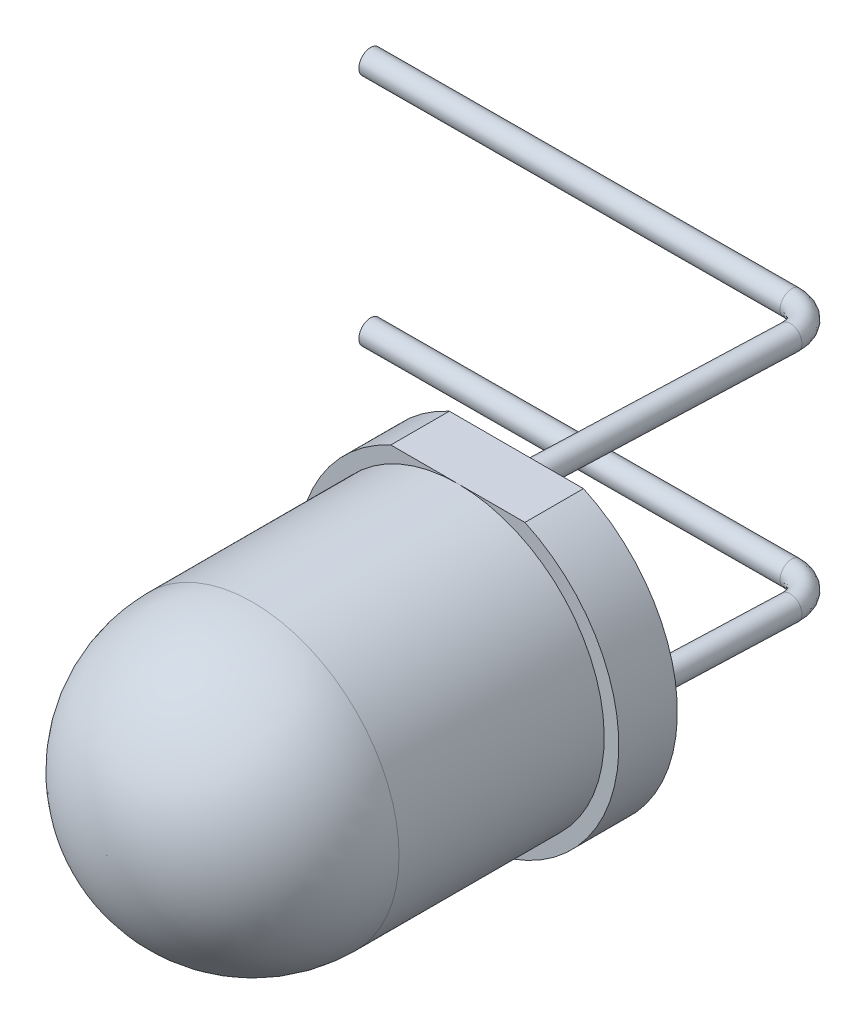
ISO-10303-21;
HEADER;
FILE_DESCRIPTION(('STEP AP214'),'2;1');
FILE_NAME('part.step','',(''),(''),'','','');
FILE_SCHEMA(('AUTOMOTIVE_DESIGN { 1 0 10303 214 1 1 1 1 }'));
ENDSEC;
DATA;
#1=APPLICATION_CONTEXT('core data for automotive mechanical design processes');
#2=APPLICATION_PROTOCOL_DEFINITION('international standard','automotive_design',2000,#1);
#3=PRODUCT_CONTEXT('',#1,'mechanical');
#4=PRODUCT('Part','Part','',(#3));
#5=PRODUCT_RELATED_PRODUCT_CATEGORY('part','',(#4));
#6=PRODUCT_DEFINITION_FORMATION('','',#4);
#7=PRODUCT_DEFINITION_CONTEXT('part definition',#1,'design');
#8=PRODUCT_DEFINITION('design','',#6,#7);
#9=PRODUCT_DEFINITION_SHAPE('','',#8);
#10=(LENGTH_UNIT() NAMED_UNIT(*) SI_UNIT(.MILLI.,.METRE.));
#11=(NAMED_UNIT(*) PLANE_ANGLE_UNIT() SI_UNIT($,.RADIAN.));
#12=(NAMED_UNIT(*) SI_UNIT($,.STERADIAN.) SOLID_ANGLE_UNIT());
#13=UNCERTAINTY_MEASURE_WITH_UNIT(LENGTH_MEASURE(1.E-05),#10,'distance_accuracy_value','');
#14=(GEOMETRIC_REPRESENTATION_CONTEXT(3) GLOBAL_UNCERTAINTY_ASSIGNED_CONTEXT((#13)) GLOBAL_UNIT_ASSIGNED_CONTEXT((#10,
#11,#12)) REPRESENTATION_CONTEXT('',''));
#15=CARTESIAN_POINT('',(0.,0.,0.));
#16=DIRECTION('',(0.,0.,1.));
#17=DIRECTION('',(1.,0.,0.));
#18=AXIS2_PLACEMENT_3D('',#15,#16,#17);
#19=CARTESIAN_POINT('',(0.,0.,14.));
#20=DIRECTION('',(0.,0.,-1.));
#21=DIRECTION('',(-1.,0.,0.));
#22=AXIS2_PLACEMENT_3D('',#19,#20,#21);
#23=CYLINDRICAL_SURFACE('',#22,5.);
#24=CARTESIAN_POINT('',(0.,0.,2.));
#25=DIRECTION('',(0.,0.,-1.));
#26=DIRECTION('',(-1.,0.,0.));
#27=AXIS2_PLACEMENT_3D('',#24,#25,#26);
#28=CIRCLE('',#27,5.);
#29=CARTESIAN_POINT('',(0.,5.,2.));
#30=VERTEX_POINT('',#29);
#31=EDGE_CURVE('E33',#30,#30,#28,.T.);
#32=ORIENTED_EDGE('',*,*,#31,.F.);
#33=EDGE_LOOP('',(#32));
#34=FACE_BOUND('',#33,.T.);
#35=CARTESIAN_POINT('',(0.,0.,9.01));
#36=DIRECTION('',(0.,0.,1.));
#37=DIRECTION('',(1.,0.,0.));
#38=AXIS2_PLACEMENT_3D('',#35,#36,#37);
#39=CIRCLE('',#38,5.);
#40=CARTESIAN_POINT('',(5.,0.,9.01));
#41=VERTEX_POINT('',#40);
#42=EDGE_CURVE('E77',#41,#41,#39,.F.);
#43=ORIENTED_EDGE('',*,*,#42,.T.);
#44=EDGE_LOOP('',(#43));
#45=FACE_BOUND('',#44,.T.);
#46=ADVANCED_FACE('F26',(#34,#45),#23,.T.);
#47=CARTESIAN_POINT('',(0.,0.,14.));
#48=DIRECTION('',(0.,0.,1.));
#49=DIRECTION('',(1.,0.,0.));
#50=AXIS2_PLACEMENT_3D('',#47,#48,#49);
#51=PLANE('',#50);
#52=CARTESIAN_POINT('',(0.,0.,14.));
#53=DIRECTION('',(0.,0.,1.));
#54=DIRECTION('',(1.,0.,0.));
#55=AXIS2_PLACEMENT_3D('',#52,#53,#54);
#56=CIRCLE('',#55,0.0100000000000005);
#57=CARTESIAN_POINT('',(0.0100000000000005,0.,14.));
#58=VERTEX_POINT('',#57);
#59=EDGE_CURVE('E68',#58,#58,#56,.T.);
#60=ORIENTED_EDGE('',*,*,#59,.T.);
#61=EDGE_LOOP('',(#60));
#62=FACE_BOUND('',#61,.T.);
#63=ADVANCED_FACE('F106',(#62),#51,.T.);
#64=CARTESIAN_POINT('',(0.,0.,9.01));
#65=DIRECTION('',(0.,0.,1.));
#66=DIRECTION('',(1.,0.,0.));
#67=AXIS2_PLACEMENT_3D('',#64,#65,#66);
#68=DEGENERATE_TOROIDAL_SURFACE('',#67,0.0100000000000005,4.99,.T.);
#69=ORIENTED_EDGE('',*,*,#42,.F.);
#70=EDGE_LOOP('',(#69));
#71=FACE_BOUND('',#70,.T.);
#72=ORIENTED_EDGE('',*,*,#59,.F.);
#73=EDGE_LOOP('',(#72));
#74=FACE_BOUND('',#73,.T.);
#75=ADVANCED_FACE('F104',(#71,#74),#68,.T.);
#76=CARTESIAN_POINT('',(0.,0.,2.));
#77=DIRECTION('',(0.,0.,-1.));
#78=DIRECTION('',(-1.,0.,0.));
#79=AXIS2_PLACEMENT_3D('',#76,#77,#78);
#80=PLANE('',#79);
#81=CARTESIAN_POINT('',(0.,0.,2.));
#82=DIRECTION('',(0.,0.,-1.));
#83=DIRECTION('',(-1.,0.,0.));
#84=AXIS2_PLACEMENT_3D('',#81,#82,#83);
#85=CIRCLE('',#84,5.5);
#86=CARTESIAN_POINT('',(2.29128784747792,5.,2.));
#87=VERTEX_POINT('',#86);
#88=CARTESIAN_POINT('',(-2.29128784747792,5.,2.));
#89=VERTEX_POINT('',#88);
#90=EDGE_CURVE('E61',#87,#89,#85,.T.);
#91=ORIENTED_EDGE('',*,*,#90,.F.);
#92=DIRECTION('',(-1.,0.,0.));
#93=VECTOR('',#92,1.);
#94=CARTESIAN_POINT('',(0.,5.,2.));
#95=LINE('',#94,#93);
#96=EDGE_CURVE('E63',#87,#30,#95,.T.);
#97=ORIENTED_EDGE('',*,*,#96,.T.);
#98=ORIENTED_EDGE('',*,*,#31,.T.);
#99=EDGE_CURVE('E62',#30,#89,#95,.T.);
#100=ORIENTED_EDGE('',*,*,#99,.T.);
#101=EDGE_LOOP('',(#91,#97,#98,#100));
#102=FACE_BOUND('',#101,.T.);
#103=ADVANCED_FACE('F114',(#102),#80,.F.);
#104=CARTESIAN_POINT('',(0.,0.,2.));
#105=DIRECTION('',(0.,0.,-1.));
#106=DIRECTION('',(-1.,0.,0.));
#107=AXIS2_PLACEMENT_3D('',#104,#105,#106);
#108=CYLINDRICAL_SURFACE('',#107,5.5);
#109=DIRECTION('',(0.,0.,-1.));
#110=VECTOR('',#109,1.);
#111=CARTESIAN_POINT('',(-2.29128784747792,5.,2.));
#112=LINE('',#111,#110);
#113=CARTESIAN_POINT('',(-2.29128784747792,5.,0.));
#114=VERTEX_POINT('',#113);
#115=EDGE_CURVE('E45',#114,#89,#112,.F.);
#116=ORIENTED_EDGE('',*,*,#115,.F.);
#117=CARTESIAN_POINT('',(0.,0.,0.));
#118=DIRECTION('',(0.,0.,-1.));
#119=DIRECTION('',(-1.,0.,0.));
#120=AXIS2_PLACEMENT_3D('',#117,#118,#119);
#121=CIRCLE('',#120,5.5);
#122=CARTESIAN_POINT('',(2.29128784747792,5.,0.));
#123=VERTEX_POINT('',#122);
#124=EDGE_CURVE('E59',#123,#114,#121,.T.);
#125=ORIENTED_EDGE('',*,*,#124,.F.);
#126=DIRECTION('',(0.,0.,-1.));
#127=VECTOR('',#126,1.);
#128=CARTESIAN_POINT('',(2.29128784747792,5.,2.));
#129=LINE('',#128,#127);
#130=EDGE_CURVE('E40',#87,#123,#129,.T.);
#131=ORIENTED_EDGE('',*,*,#130,.F.);
#132=ORIENTED_EDGE('',*,*,#90,.T.);
#133=EDGE_LOOP('',(#116,#125,#131,#132));
#134=FACE_BOUND('',#133,.T.);
#135=ADVANCED_FACE('F58',(#134),#108,.T.);
#136=CARTESIAN_POINT('',(0.,0.,0.));
#137=DIRECTION('',(0.,0.,1.));
#138=DIRECTION('',(1.,0.,0.));
#139=AXIS2_PLACEMENT_3D('',#136,#137,#138);
#140=PLANE('',#139);
#141=CARTESIAN_POINT('',(0.4,-4.,0.));
#142=CARTESIAN_POINT('',(0.400002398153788,-3.97751394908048,0.));
#143=CARTESIAN_POINT('',(0.39810149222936,-3.95504257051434,0.));
#144=CARTESIAN_POINT('',(0.390552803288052,-3.91070244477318,0.));
#145=CARTESIAN_POINT('',(0.384900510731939,-3.88883445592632,0.));
#146=CARTESIAN_POINT('',(0.370012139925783,-3.84638848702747,0.));
#147=CARTESIAN_POINT('',(0.360780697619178,-3.82580887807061,0.));
#148=CARTESIAN_POINT('',(0.338980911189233,-3.78646223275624,0.));
#149=CARTESIAN_POINT('',(0.326407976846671,-3.7676977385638,0.));
#150=CARTESIAN_POINT('',(0.29830800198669,-3.73257238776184,0.));
#151=CARTESIAN_POINT('',(0.282785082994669,-3.71620823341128,0.));
#152=CARTESIAN_POINT('',(0.249190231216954,-3.68629510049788,0.));
#153=CARTESIAN_POINT('',(0.231114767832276,-3.67275008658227,0.));
#154=CARTESIAN_POINT('',(0.192971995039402,-3.6489060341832,0.));
#155=CARTESIAN_POINT('',(0.172907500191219,-3.63860249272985,0.));
#156=CARTESIAN_POINT('',(0.131305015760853,-3.6214956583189,0.));
#157=CARTESIAN_POINT('',(0.109765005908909,-3.61469727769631,0.));
#158=CARTESIAN_POINT('',(0.0658798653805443,-3.60482281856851,0.));
#159=CARTESIAN_POINT('',(0.0435359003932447,-3.601741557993,0.));
#160=CARTESIAN_POINT('',(-0.00138385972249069,-3.59936970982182,0.));
#161=CARTESIAN_POINT('',(-0.023959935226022,-3.60008442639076,0.));
#162=CARTESIAN_POINT('',(-0.0686397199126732,-3.60529282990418,0.));
#163=CARTESIAN_POINT('',(-0.0907440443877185,-3.60978124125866,0.));
#164=CARTESIAN_POINT('',(-0.133916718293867,-3.62241178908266,0.));
#165=CARTESIAN_POINT('',(-0.154983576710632,-3.63055902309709,0.));
#166=CARTESIAN_POINT('',(-0.19542070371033,-3.65026308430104,0.));
#167=CARTESIAN_POINT('',(-0.214793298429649,-3.66181513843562,0.));
#168=CARTESIAN_POINT('',(-0.251351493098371,-3.68802408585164,0.));
#169=CARTESIAN_POINT('',(-0.268534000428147,-3.70268529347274,0.));
#170=CARTESIAN_POINT('',(-0.300169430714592,-3.73466347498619,0.));
#171=CARTESIAN_POINT('',(-0.314626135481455,-3.75197670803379,0.));
#172=CARTESIAN_POINT('',(-0.340448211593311,-3.78880917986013,0.));
#173=CARTESIAN_POINT('',(-0.351809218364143,-3.80833147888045,0.));
#174=CARTESIAN_POINT('',(-0.371075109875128,-3.84897587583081,0.));
#175=CARTESIAN_POINT('',(-0.378985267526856,-3.87009547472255,0.));
#176=CARTESIAN_POINT('',(-0.391160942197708,-3.9133985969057,0.));
#177=CARTESIAN_POINT('',(-0.395420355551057,-3.93558383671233,0.));
#178=CARTESIAN_POINT('',(-0.400150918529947,-3.98035459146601,0.));
#179=CARTESIAN_POINT('',(-0.400622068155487,-4.00294010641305,0.));
#180=CARTESIAN_POINT('',(-0.397765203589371,-4.04783159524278,0.));
#181=CARTESIAN_POINT('',(-0.39444351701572,-4.07013797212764,0.));
#182=CARTESIAN_POINT('',(-0.384097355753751,-4.11391123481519,0.));
#183=CARTESIAN_POINT('',(-0.37706720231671,-4.1353767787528,0.));
#184=CARTESIAN_POINT('',(-0.35951297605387,-4.17679247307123,0.));
#185=CARTESIAN_POINT('',(-0.348993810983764,-4.19674470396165,0.));
#186=CARTESIAN_POINT('',(-0.324740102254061,-4.23462823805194,0.));
#187=CARTESIAN_POINT('',(-0.311001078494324,-4.2525566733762,0.));
#188=CARTESIAN_POINT('',(-0.280727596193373,-4.28582718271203,0.));
#189=CARTESIAN_POINT('',(-0.264197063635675,-4.30117282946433,0.));
#190=CARTESIAN_POINT('',(-0.22877084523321,-4.32889275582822,0.));
#191=CARTESIAN_POINT('',(-0.209871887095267,-4.34126285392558,0.));
#192=CARTESIAN_POINT('',(-0.170292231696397,-4.36263717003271,0.));
#193=CARTESIAN_POINT('',(-0.149614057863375,-4.37164606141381,0.));
#194=CARTESIAN_POINT('',(-0.107009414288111,-4.38607710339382,0.));
#195=CARTESIAN_POINT('',(-0.0850812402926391,-4.39149422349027,0.));
#196=CARTESIAN_POINT('',(-0.0406577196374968,-4.39856255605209,0.));
#197=CARTESIAN_POINT('',(-0.0181632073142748,-4.40021901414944,0.));
#198=CARTESIAN_POINT('',(0.0268165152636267,-4.39973418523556,0.));
#199=CARTESIAN_POINT('',(0.0493016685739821,-4.39758758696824,0.));
#200=CARTESIAN_POINT('',(0.093560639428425,-4.3895530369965,0.));
#201=CARTESIAN_POINT('',(0.115335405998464,-4.38367031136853,0.));
#202=CARTESIAN_POINT('',(0.157619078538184,-4.36832426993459,0.));
#203=CARTESIAN_POINT('',(0.17812617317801,-4.35885596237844,0.));
#204=CARTESIAN_POINT('',(0.217230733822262,-4.33662438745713,0.));
#205=CARTESIAN_POINT('',(0.23583082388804,-4.32386573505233,0.));
#206=CARTESIAN_POINT('',(0.270651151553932,-4.29538866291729,0.));
#207=CARTESIAN_POINT('',(0.28686804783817,-4.27966615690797,0.));
#208=CARTESIAN_POINT('',(0.316409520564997,-4.24574432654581,0.));
#209=CARTESIAN_POINT('',(0.329738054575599,-4.22754844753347,0.));
#210=CARTESIAN_POINT('',(0.353168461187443,-4.18915131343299,0.));
#211=CARTESIAN_POINT('',(0.363266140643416,-4.1689474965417,0.));
#212=CARTESIAN_POINT('',(0.379914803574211,-4.1271641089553,0.));
#213=CARTESIAN_POINT('',(0.386470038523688,-4.10558622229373,0.));
#214=CARTESIAN_POINT('',(0.397029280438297,-4.05615115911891,0.));
#215=CARTESIAN_POINT('',(0.399997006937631,-4.02806415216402,0.));
#216=CARTESIAN_POINT('',(0.4,-4.,0.));
#217=B_SPLINE_CURVE_WITH_KNOTS('',3,(#141,#142,#143,#144,#145,#146,#147,#148,#149,#150,#151,
#152,#153,#154,#155,#156,#157,#158,#159,#160,#161,#162,#163,#164,#165,#166,#167,#168,#169,#170,
#171,#172,#173,#174,#175,#176,#177,#178,#179,#180,#181,#182,#183,#184,#185,#186,#187,#188,#189,
#190,#191,#192,#193,#194,#195,#196,#197,#198,#199,#200,#201,#202,#203,#204,#205,#206,#207,#208,
#209,#210,#211,#212,#213,#214,#215,#216),.UNSPECIFIED.,.T.,.F.,(4,2,2,2,2,2,2,2,2,2,2,2,2,2,2,2,
2,2,2,2,2,2,2,2,2,2,2,2,2,2,2,2,2,2,2,2,2,4),(0.,0.0673532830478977,0.134787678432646,
0.202135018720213,0.269575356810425,0.336922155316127,0.404363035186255,0.471709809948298,
0.539150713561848,0.606497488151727,0.673938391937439,0.741285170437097,0.80872607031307,
0.876072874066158,0.943513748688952,1.01086035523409,1.07830142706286,1.14563908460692,
1.21308910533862,1.28053912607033,1.34787678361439,1.41531785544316,1.4826644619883,
1.55010533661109,1.61745214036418,1.68489304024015,1.75223981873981,1.81968072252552,
1.8870274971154,1.95446840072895,2.02181517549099,2.08925605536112,2.15660285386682,
2.22404319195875,2.29139053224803,2.3588249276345,2.4261782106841,2.51023978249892),.UNSPECIFIED.);
#218=CARTESIAN_POINT('',(0.4,-4.,0.));
#219=VERTEX_POINT('',#218);
#220=EDGE_CURVE('E90',#219,#219,#217,.F.);
#221=ORIENTED_EDGE('',*,*,#220,.F.);
#222=EDGE_LOOP('',(#221));
#223=FACE_BOUND('',#222,.T.);
#224=CARTESIAN_POINT('',(0.4,4.,0.));
#225=CARTESIAN_POINT('',(0.400002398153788,4.02248605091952,0.));
#226=CARTESIAN_POINT('',(0.39810149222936,4.04495742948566,0.));
#227=CARTESIAN_POINT('',(0.390552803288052,4.08929755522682,0.));
#228=CARTESIAN_POINT('',(0.384900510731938,4.11116554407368,0.));
#229=CARTESIAN_POINT('',(0.370012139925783,4.15361151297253,0.));
#230=CARTESIAN_POINT('',(0.360780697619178,4.17419112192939,0.));
#231=CARTESIAN_POINT('',(0.338980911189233,4.21353776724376,0.));
#232=CARTESIAN_POINT('',(0.326407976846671,4.2323022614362,0.));
#233=CARTESIAN_POINT('',(0.298308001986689,4.26742761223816,0.));
#234=CARTESIAN_POINT('',(0.282785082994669,4.28379176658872,0.));
#235=CARTESIAN_POINT('',(0.249190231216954,4.31370489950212,0.));
#236=CARTESIAN_POINT('',(0.231114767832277,4.32724991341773,0.));
#237=CARTESIAN_POINT('',(0.192971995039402,4.3510939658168,0.));
#238=CARTESIAN_POINT('',(0.17290750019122,4.36139750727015,0.));
#239=CARTESIAN_POINT('',(0.131305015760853,4.37850434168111,0.));
#240=CARTESIAN_POINT('',(0.109765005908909,4.38530272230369,0.));
#241=CARTESIAN_POINT('',(0.0658798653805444,4.39517718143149,0.));
#242=CARTESIAN_POINT('',(0.0435359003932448,4.398258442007,0.));
#243=CARTESIAN_POINT('',(-0.00138385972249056,4.40063029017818,0.));
#244=CARTESIAN_POINT('',(-0.0239599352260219,4.39991557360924,0.));
#245=CARTESIAN_POINT('',(-0.0686397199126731,4.39470717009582,0.));
#246=CARTESIAN_POINT('',(-0.0907440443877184,4.39021875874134,0.));
#247=CARTESIAN_POINT('',(-0.133916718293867,4.37758821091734,0.));
#248=CARTESIAN_POINT('',(-0.154983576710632,4.36944097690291,0.));
#249=CARTESIAN_POINT('',(-0.19542070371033,4.34973691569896,0.));
#250=CARTESIAN_POINT('',(-0.21479329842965,4.33818486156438,0.));
#251=CARTESIAN_POINT('',(-0.251351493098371,4.31197591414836,0.));
#252=CARTESIAN_POINT('',(-0.268534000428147,4.29731470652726,0.));
#253=CARTESIAN_POINT('',(-0.300169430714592,4.26533652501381,0.));
#254=CARTESIAN_POINT('',(-0.314626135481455,4.24802329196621,0.));
#255=CARTESIAN_POINT('',(-0.34044821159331,4.21119082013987,0.));
#256=CARTESIAN_POINT('',(-0.351809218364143,4.19166852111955,0.));
#257=CARTESIAN_POINT('',(-0.371075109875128,4.15102412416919,0.));
#258=CARTESIAN_POINT('',(-0.378985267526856,4.12990452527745,0.));
#259=CARTESIAN_POINT('',(-0.391160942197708,4.0866014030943,0.));
#260=CARTESIAN_POINT('',(-0.395420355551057,4.06441616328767,0.));
#261=CARTESIAN_POINT('',(-0.400150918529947,4.01964540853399,0.));
#262=CARTESIAN_POINT('',(-0.400622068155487,3.99705989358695,0.));
#263=CARTESIAN_POINT('',(-0.397765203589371,3.95216840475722,0.));
#264=CARTESIAN_POINT('',(-0.39444351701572,3.92986202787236,0.));
#265=CARTESIAN_POINT('',(-0.384097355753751,3.88608876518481,0.));
#266=CARTESIAN_POINT('',(-0.37706720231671,3.8646232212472,0.));
#267=CARTESIAN_POINT('',(-0.35951297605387,3.82320752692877,0.));
#268=CARTESIAN_POINT('',(-0.348993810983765,3.80325529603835,0.));
#269=CARTESIAN_POINT('',(-0.324740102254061,3.76537176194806,0.));
#270=CARTESIAN_POINT('',(-0.311001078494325,3.7474433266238,0.));
#271=CARTESIAN_POINT('',(-0.280727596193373,3.71417281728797,0.));
#272=CARTESIAN_POINT('',(-0.264197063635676,3.69882717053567,0.));
#273=CARTESIAN_POINT('',(-0.22877084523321,3.67110724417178,0.));
#274=CARTESIAN_POINT('',(-0.209871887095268,3.65873714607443,0.));
#275=CARTESIAN_POINT('',(-0.170292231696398,3.63736282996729,0.));
#276=CARTESIAN_POINT('',(-0.149614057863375,3.62835393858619,0.));
#277=CARTESIAN_POINT('',(-0.107009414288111,3.61392289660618,0.));
#278=CARTESIAN_POINT('',(-0.0850812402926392,3.60850577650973,0.));
#279=CARTESIAN_POINT('',(-0.0406577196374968,3.60143744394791,0.));
#280=CARTESIAN_POINT('',(-0.0181632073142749,3.59978098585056,0.));
#281=CARTESIAN_POINT('',(0.0268165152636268,3.60026581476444,0.));
#282=CARTESIAN_POINT('',(0.0493016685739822,3.60241241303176,0.));
#283=CARTESIAN_POINT('',(0.0935606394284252,3.6104469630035,0.));
#284=CARTESIAN_POINT('',(0.115335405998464,3.61632968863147,0.));
#285=CARTESIAN_POINT('',(0.157619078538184,3.63167573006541,0.));
#286=CARTESIAN_POINT('',(0.17812617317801,3.64114403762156,0.));
#287=CARTESIAN_POINT('',(0.217230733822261,3.66337561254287,0.));
#288=CARTESIAN_POINT('',(0.235830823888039,3.67613426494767,0.));
#289=CARTESIAN_POINT('',(0.270651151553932,3.70461133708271,0.));
#290=CARTESIAN_POINT('',(0.28686804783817,3.72033384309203,0.));
#291=CARTESIAN_POINT('',(0.316409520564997,3.75425567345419,0.));
#292=CARTESIAN_POINT('',(0.329738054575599,3.77245155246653,0.));
#293=CARTESIAN_POINT('',(0.353168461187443,3.81084868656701,0.));
#294=CARTESIAN_POINT('',(0.363266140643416,3.8310525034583,0.));
#295=CARTESIAN_POINT('',(0.379914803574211,3.8728358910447,0.));
#296=CARTESIAN_POINT('',(0.386470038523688,3.89441377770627,0.));
#297=CARTESIAN_POINT('',(0.397029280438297,3.94384884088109,0.));
#298=CARTESIAN_POINT('',(0.399997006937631,3.97193584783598,0.));
#299=CARTESIAN_POINT('',(0.4,4.,0.));
#300=B_SPLINE_CURVE_WITH_KNOTS('',3,(#224,#225,#226,#227,#228,#229,#230,#231,#232,#233,#234,
#235,#236,#237,#238,#239,#240,#241,#242,#243,#244,#245,#246,#247,#248,#249,#250,#251,#252,#253,
#254,#255,#256,#257,#258,#259,#260,#261,#262,#263,#264,#265,#266,#267,#268,#269,#270,#271,#272,
#273,#274,#275,#276,#277,#278,#279,#280,#281,#282,#283,#284,#285,#286,#287,#288,#289,#290,#291,
#292,#293,#294,#295,#296,#297,#298,#299),.UNSPECIFIED.,.T.,.F.,(4,2,2,2,2,2,2,2,2,2,2,2,2,2,2,2,
2,2,2,2,2,2,2,2,2,2,2,2,2,2,2,2,2,2,2,2,2,4),(0.,0.0673532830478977,0.134787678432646,
0.202135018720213,0.269575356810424,0.336922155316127,0.404363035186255,0.471709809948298,
0.539150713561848,0.606497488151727,0.673938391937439,0.741285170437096,0.80872607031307,
0.876072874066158,0.943513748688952,1.01086035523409,1.07830142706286,1.14563908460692,
1.21308910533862,1.28053912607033,1.34787678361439,1.41531785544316,1.4826644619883,
1.55010533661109,1.61745214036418,1.68489304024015,1.75223981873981,1.81968072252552,
1.8870274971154,1.95446840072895,2.02181517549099,2.08925605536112,2.15660285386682,
2.22404319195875,2.29139053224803,2.35882492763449,2.4261782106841,2.51023978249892),.UNSPECIFIED.);
#301=CARTESIAN_POINT('',(0.4,4.,0.));
#302=VERTEX_POINT('',#301);
#303=EDGE_CURVE('E82',#302,#302,#300,.F.);
#304=ORIENTED_EDGE('',*,*,#303,.F.);
#305=EDGE_LOOP('',(#304));
#306=FACE_BOUND('',#305,.T.);
#307=ORIENTED_EDGE('',*,*,#124,.T.);
#308=DIRECTION('',(1.,0.,0.));
#309=VECTOR('',#308,1.);
#310=CARTESIAN_POINT('',(0.,5.,0.));
#311=LINE('',#310,#309);
#312=EDGE_CURVE('E11',#114,#123,#311,.T.);
#313=ORIENTED_EDGE('',*,*,#312,.T.);
#314=EDGE_LOOP('',(#307,#313));
#315=FACE_BOUND('',#314,.T.);
#316=ADVANCED_FACE('F65',(#223,#306,#315),#140,.F.);
#317=CARTESIAN_POINT('',(-0.667727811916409,4.,-10.058249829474));
#318=DIRECTION('',(-0.999149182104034,0.,0.0412421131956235));
#319=DIRECTION('',(0.0412421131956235,0.,0.999149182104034));
#320=AXIS2_PLACEMENT_3D('',#317,#318,#319);
#321=CIRCLE('',#320,0.4);
#322=DIRECTION('',(-0.999991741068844,0.,0.00406420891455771));
#323=VECTOR('',#322,1.);
#324=SURFACE_OF_LINEAR_EXTRUSION('',#321,#323);
#325=CARTESIAN_POINT('',(-0.65123096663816,4.,-9.65859015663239));
#326=VERTEX_POINT('',#325);
#327=EDGE_CURVE('E71',#326,#326,#321,.T.);
#328=ORIENTED_EDGE('',*,*,#327,.T.);
#329=EDGE_LOOP('',(#328));
#330=FACE_BOUND('',#329,.T.);
#331=CARTESIAN_POINT('',(-15.,4.,-10.));
#332=DIRECTION('',(-0.999149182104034,0.,0.0412421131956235));
#333=DIRECTION('',(0.0412421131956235,0.,0.999149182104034));
#334=AXIS2_PLACEMENT_3D('',#331,#332,#333);
#335=CIRCLE('',#334,0.4);
#336=CARTESIAN_POINT('',(-14.9835031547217,4.,-9.60034032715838));
#337=VERTEX_POINT('',#336);
#338=EDGE_CURVE('E66',#337,#337,#335,.T.);
#339=ORIENTED_EDGE('',*,*,#338,.F.);
#340=EDGE_LOOP('',(#339));
#341=FACE_BOUND('',#340,.T.);
#342=ADVANCED_FACE('F102',(#330,#341),#324,.T.);
#343=CARTESIAN_POINT('',(0.335644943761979,4.,-9.02107706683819));
#344=DIRECTION('',(0.,0.,-1.));
#345=DIRECTION('',(-1.,0.,0.));
#346=AXIS2_PLACEMENT_3D('',#343,#344,#345);
#347=CIRCLE('',#346,0.4);
#348=CARTESIAN_POINT('',(-0.66366360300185,4.,-9.05825808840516));
#349=DIRECTION('',(0.,1.,0.));
#350=AXIS1_PLACEMENT('',#348,#349);
#351=SURFACE_OF_REVOLUTION('',#347,#350);
#352=CARTESIAN_POINT('',(-0.0643550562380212,4.,-9.02107706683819));
#353=VERTEX_POINT('',#352);
#354=EDGE_CURVE('E88',#353,#353,#347,.T.);
#355=ORIENTED_EDGE('',*,*,#354,.T.);
#356=EDGE_LOOP('',(#355));
#357=FACE_BOUND('',#356,.T.);
#358=ORIENTED_EDGE('',*,*,#327,.F.);
#359=EDGE_LOOP('',(#358));
#360=FACE_BOUND('',#359,.T.);
#361=ADVANCED_FACE('F161',(#357,#360),#351,.F.);
#362=DIRECTION('',(-0.0371810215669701,0.,0.999308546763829));
#363=VECTOR('',#362,1.);
#364=SURFACE_OF_LINEAR_EXTRUSION('',#347,#363);
#365=ORIENTED_EDGE('',*,*,#354,.F.);
#366=EDGE_LOOP('',(#365));
#367=FACE_BOUND('',#366,.T.);
#368=ORIENTED_EDGE('',*,*,#303,.T.);
#369=EDGE_LOOP('',(#368));
#370=FACE_BOUND('',#369,.T.);
#371=ADVANCED_FACE('F94',(#367,#370),#364,.F.);
#372=CARTESIAN_POINT('',(-15.,4.,-10.));
#373=DIRECTION('',(-0.999149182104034,0.,0.0412421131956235));
#374=DIRECTION('',(0.0412421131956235,0.,0.999149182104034));
#375=AXIS2_PLACEMENT_3D('',#372,#373,#374);
#376=PLANE('',#375);
#377=ORIENTED_EDGE('',*,*,#338,.T.);
#378=EDGE_LOOP('',(#377));
#379=FACE_BOUND('',#378,.T.);
#380=ADVANCED_FACE('F154',(#379),#376,.T.);
#381=CARTESIAN_POINT('',(-0.667727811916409,-4.,-10.058249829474));
#382=DIRECTION('',(-0.999149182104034,0.,0.0412421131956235));
#383=DIRECTION('',(0.0412421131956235,0.,0.999149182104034));
#384=AXIS2_PLACEMENT_3D('',#381,#382,#383);
#385=CIRCLE('',#384,0.4);
#386=DIRECTION('',(-0.999991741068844,0.,0.00406420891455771));
#387=VECTOR('',#386,1.);
#388=SURFACE_OF_LINEAR_EXTRUSION('',#385,#387);
#389=CARTESIAN_POINT('',(-0.65123096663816,-4.,-9.65859015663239));
#390=VERTEX_POINT('',#389);
#391=EDGE_CURVE('E135',#390,#390,#385,.T.);
#392=ORIENTED_EDGE('',*,*,#391,.T.);
#393=EDGE_LOOP('',(#392));
#394=FACE_BOUND('',#393,.T.);
#395=CARTESIAN_POINT('',(-15.,-4.,-10.));
#396=DIRECTION('',(-0.999149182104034,0.,0.0412421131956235));
#397=DIRECTION('',(0.0412421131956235,0.,0.999149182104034));
#398=AXIS2_PLACEMENT_3D('',#395,#396,#397);
#399=CIRCLE('',#398,0.4);
#400=CARTESIAN_POINT('',(-14.9835031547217,-4.,-9.60034032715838));
#401=VERTEX_POINT('',#400);
#402=EDGE_CURVE('E89',#401,#401,#399,.T.);
#403=ORIENTED_EDGE('',*,*,#402,.F.);
#404=EDGE_LOOP('',(#403));
#405=FACE_BOUND('',#404,.T.);
#406=ADVANCED_FACE('F152',(#394,#405),#388,.T.);
#407=CARTESIAN_POINT('',(0.335644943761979,-4.,-9.02107706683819));
#408=DIRECTION('',(0.,0.,-1.));
#409=DIRECTION('',(-1.,0.,0.));
#410=AXIS2_PLACEMENT_3D('',#407,#408,#409);
#411=CIRCLE('',#410,0.4);
#412=CARTESIAN_POINT('',(-0.66366360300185,-4.,-9.05825808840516));
#413=DIRECTION('',(0.,1.,0.));
#414=AXIS1_PLACEMENT('',#412,#413);
#415=SURFACE_OF_REVOLUTION('',#411,#414);
#416=CARTESIAN_POINT('',(-0.0643550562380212,-4.,-9.02107706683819));
#417=VERTEX_POINT('',#416);
#418=EDGE_CURVE('E131',#417,#417,#411,.T.);
#419=ORIENTED_EDGE('',*,*,#418,.T.);
#420=EDGE_LOOP('',(#419));
#421=FACE_BOUND('',#420,.T.);
#422=ORIENTED_EDGE('',*,*,#391,.F.);
#423=EDGE_LOOP('',(#422));
#424=FACE_BOUND('',#423,.T.);
#425=ADVANCED_FACE('F149',(#421,#424),#415,.F.);
#426=DIRECTION('',(-0.0371810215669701,0.,0.999308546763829));
#427=VECTOR('',#426,1.);
#428=SURFACE_OF_LINEAR_EXTRUSION('',#411,#427);
#429=ORIENTED_EDGE('',*,*,#418,.F.);
#430=EDGE_LOOP('',(#429));
#431=FACE_BOUND('',#430,.T.);
#432=ORIENTED_EDGE('',*,*,#220,.T.);
#433=EDGE_LOOP('',(#432));
#434=FACE_BOUND('',#433,.T.);
#435=ADVANCED_FACE('F145',(#431,#434),#428,.F.);
#436=CARTESIAN_POINT('',(-15.,-4.,-10.));
#437=DIRECTION('',(-0.999149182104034,0.,0.0412421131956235));
#438=DIRECTION('',(0.0412421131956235,0.,0.999149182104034));
#439=AXIS2_PLACEMENT_3D('',#436,#437,#438);
#440=PLANE('',#439);
#441=ORIENTED_EDGE('',*,*,#402,.T.);
#442=EDGE_LOOP('',(#441));
#443=FACE_BOUND('',#442,.T.);
#444=ADVANCED_FACE('F180',(#443),#440,.T.);
#445=CARTESIAN_POINT('',(-5.04950368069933,5.,12.));
#446=DIRECTION('',(0.,-1.,0.));
#447=DIRECTION('',(0.,0.,-1.));
#448=AXIS2_PLACEMENT_3D('',#445,#446,#447);
#449=PLANE('',#448);
#450=ORIENTED_EDGE('',*,*,#96,.F.);
#451=ORIENTED_EDGE('',*,*,#130,.T.);
#452=ORIENTED_EDGE('',*,*,#312,.F.);
#453=ORIENTED_EDGE('',*,*,#115,.T.);
#454=ORIENTED_EDGE('',*,*,#99,.F.);
#455=EDGE_LOOP('',(#450,#451,#452,#453,#454));
#456=FACE_BOUND('',#455,.T.);
#457=ADVANCED_FACE('F52',(#456),#449,.F.);
#458=CLOSED_SHELL('',(#46,#63,#75,#103,#135,#316,#342,#361,#371,#380,#406,#425,#435,#444,#457));
#459=MANIFOLD_SOLID_BREP('B2',#458);
#460=ADVANCED_BREP_SHAPE_REPRESENTATION('',(#18,#459),#14);
#461=SHAPE_DEFINITION_REPRESENTATION(#9,#460);
ENDSEC;
END-ISO-10303-21;
